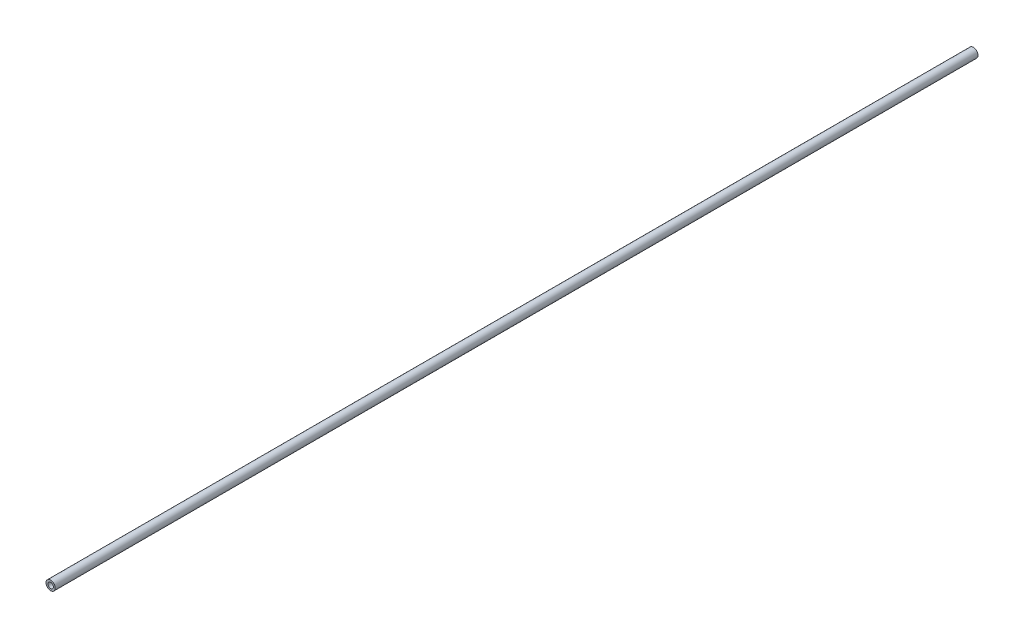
ISO-10303-21;
HEADER;
FILE_DESCRIPTION(('STEP AP214'),'2;1');
FILE_NAME('part.step','',(''),(''),'','','');
FILE_SCHEMA(('AUTOMOTIVE_DESIGN { 1 0 10303 214 1 1 1 1 }'));
ENDSEC;
DATA;
#1=APPLICATION_CONTEXT('core data for automotive mechanical design processes');
#2=APPLICATION_PROTOCOL_DEFINITION('international standard','automotive_design',2000,#1);
#3=PRODUCT_CONTEXT('',#1,'mechanical');
#4=PRODUCT('Part','Part','',(#3));
#5=PRODUCT_RELATED_PRODUCT_CATEGORY('part','',(#4));
#6=PRODUCT_DEFINITION_FORMATION('','',#4);
#7=PRODUCT_DEFINITION_CONTEXT('part definition',#1,'design');
#8=PRODUCT_DEFINITION('design','',#6,#7);
#9=PRODUCT_DEFINITION_SHAPE('','',#8);
#10=(LENGTH_UNIT() NAMED_UNIT(*) SI_UNIT(.MILLI.,.METRE.));
#11=(NAMED_UNIT(*) PLANE_ANGLE_UNIT() SI_UNIT($,.RADIAN.));
#12=(NAMED_UNIT(*) SI_UNIT($,.STERADIAN.) SOLID_ANGLE_UNIT());
#13=UNCERTAINTY_MEASURE_WITH_UNIT(LENGTH_MEASURE(1.E-05),#10,'distance_accuracy_value','');
#14=(GEOMETRIC_REPRESENTATION_CONTEXT(3) GLOBAL_UNCERTAINTY_ASSIGNED_CONTEXT((#13)) GLOBAL_UNIT_ASSIGNED_CONTEXT((#10,
#11,#12)) REPRESENTATION_CONTEXT('',''));
#15=CARTESIAN_POINT('',(0.,0.,0.));
#16=DIRECTION('',(0.,0.,1.));
#17=DIRECTION('',(1.,0.,0.));
#18=AXIS2_PLACEMENT_3D('',#15,#16,#17);
#19=CARTESIAN_POINT('',(0.,0.,0.));
#20=DIRECTION('',(0.,0.,1.));
#21=DIRECTION('',(1.,0.,0.));
#22=AXIS2_PLACEMENT_3D('',#19,#20,#21);
#23=PLANE('',#22);
#24=CARTESIAN_POINT('',(0.,0.,0.));
#25=DIRECTION('',(0.,0.,1.));
#26=DIRECTION('',(1.,0.,0.));
#27=AXIS2_PLACEMENT_3D('',#24,#25,#26);
#28=CIRCLE('',#27,6.);
#29=CARTESIAN_POINT('',(6.,0.,0.));
#30=VERTEX_POINT('',#29);
#31=EDGE_CURVE('E55',#30,#30,#28,.T.);
#32=ORIENTED_EDGE('',*,*,#31,.T.);
#33=EDGE_LOOP('',(#32));
#34=FACE_BOUND('',#33,.T.);
#35=CARTESIAN_POINT('',(0.,0.,0.));
#36=DIRECTION('',(0.,0.,1.));
#37=DIRECTION('',(1.,0.,0.));
#38=AXIS2_PLACEMENT_3D('',#35,#36,#37);
#39=CIRCLE('',#38,10.);
#40=CARTESIAN_POINT('',(10.,0.,0.));
#41=VERTEX_POINT('',#40);
#42=EDGE_CURVE('E47',#41,#41,#39,.T.);
#43=ORIENTED_EDGE('',*,*,#42,.F.);
#44=EDGE_LOOP('',(#43));
#45=FACE_BOUND('',#44,.T.);
#46=ADVANCED_FACE('F41',(#34,#45),#23,.F.);
#47=CARTESIAN_POINT('',(0.,-2.44929359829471E-13,2000.));
#48=DIRECTION('',(0.,0.,1.));
#49=DIRECTION('',(1.,0.,0.));
#50=AXIS2_PLACEMENT_3D('',#47,#48,#49);
#51=PLANE('',#50);
#52=CARTESIAN_POINT('',(0.,-2.44929359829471E-13,2000.));
#53=DIRECTION('',(0.,0.,1.));
#54=DIRECTION('',(1.,0.,0.));
#55=AXIS2_PLACEMENT_3D('',#52,#53,#54);
#56=CIRCLE('',#55,6.);
#57=CARTESIAN_POINT('',(6.,-2.44929359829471E-13,2000.));
#58=VERTEX_POINT('',#57);
#59=EDGE_CURVE('E51',#58,#58,#56,.T.);
#60=ORIENTED_EDGE('',*,*,#59,.F.);
#61=EDGE_LOOP('',(#60));
#62=FACE_BOUND('',#61,.T.);
#63=CARTESIAN_POINT('',(0.,-2.44929359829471E-13,2000.));
#64=DIRECTION('',(0.,0.,1.));
#65=DIRECTION('',(1.,0.,0.));
#66=AXIS2_PLACEMENT_3D('',#63,#64,#65);
#67=CIRCLE('',#66,10.);
#68=CARTESIAN_POINT('',(10.,-2.44929359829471E-13,2000.));
#69=VERTEX_POINT('',#68);
#70=EDGE_CURVE('E12',#69,#69,#67,.T.);
#71=ORIENTED_EDGE('',*,*,#70,.T.);
#72=EDGE_LOOP('',(#71));
#73=FACE_BOUND('',#72,.T.);
#74=ADVANCED_FACE('F71',(#62,#73),#51,.T.);
#75=CARTESIAN_POINT('',(0.,0.,0.));
#76=DIRECTION('',(0.,0.,1.));
#77=DIRECTION('',(0.,-1.,0.));
#78=AXIS2_PLACEMENT_3D('',#75,#76,#77);
#79=CYLINDRICAL_SURFACE('',#78,10.);
#80=ORIENTED_EDGE('',*,*,#70,.F.);
#81=EDGE_LOOP('',(#80));
#82=FACE_BOUND('',#81,.T.);
#83=ORIENTED_EDGE('',*,*,#42,.T.);
#84=EDGE_LOOP('',(#83));
#85=FACE_BOUND('',#84,.T.);
#86=ADVANCED_FACE('F65',(#82,#85),#79,.T.);
#87=CARTESIAN_POINT('',(0.,0.,0.));
#88=DIRECTION('',(0.,0.,1.));
#89=DIRECTION('',(0.,-1.,0.));
#90=AXIS2_PLACEMENT_3D('',#87,#88,#89);
#91=CYLINDRICAL_SURFACE('',#90,6.);
#92=ORIENTED_EDGE('',*,*,#59,.T.);
#93=EDGE_LOOP('',(#92));
#94=FACE_BOUND('',#93,.T.);
#95=ORIENTED_EDGE('',*,*,#31,.F.);
#96=EDGE_LOOP('',(#95));
#97=FACE_BOUND('',#96,.T.);
#98=ADVANCED_FACE('F63',(#94,#97),#91,.F.);
#99=CLOSED_SHELL('',(#46,#74,#86,#98));
#100=MANIFOLD_SOLID_BREP('B2',#99);
#101=ADVANCED_BREP_SHAPE_REPRESENTATION('',(#18,#100),#14);
#102=SHAPE_DEFINITION_REPRESENTATION(#9,#101);
ENDSEC;
END-ISO-10303-21;
